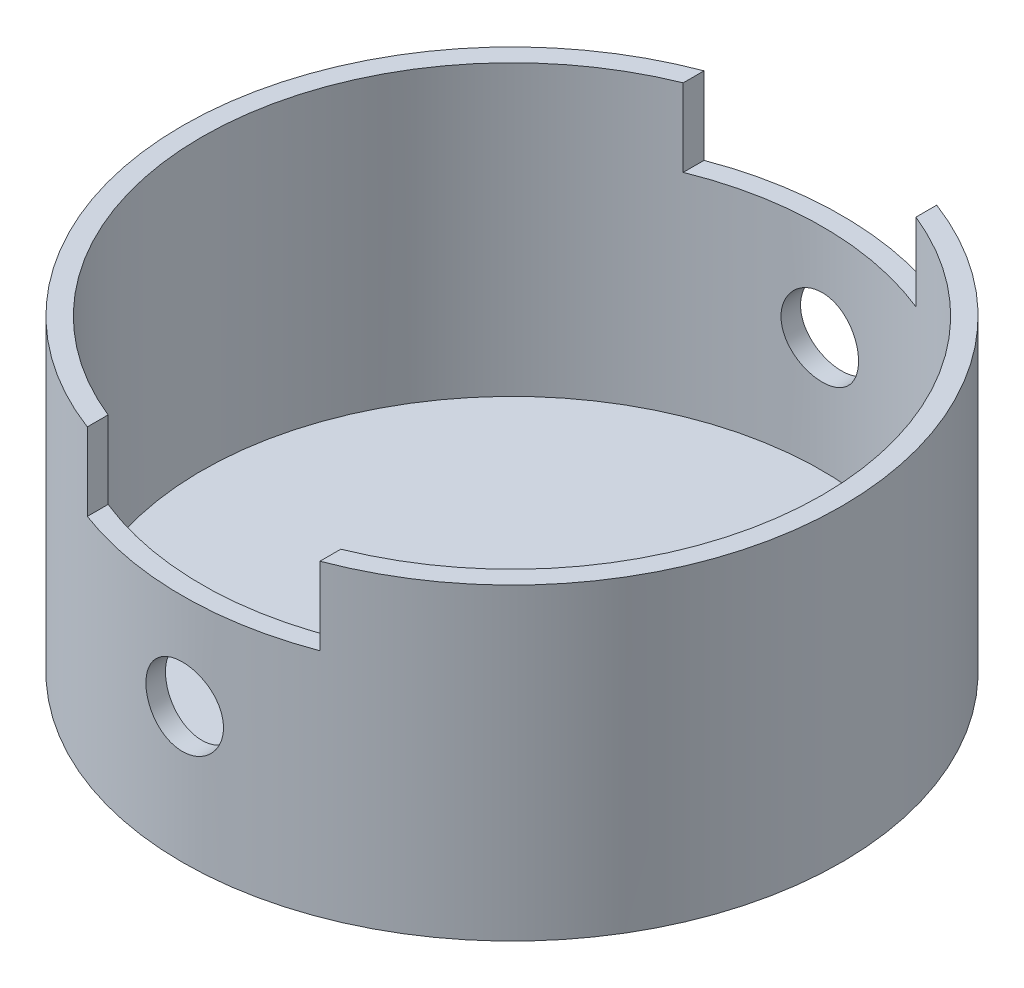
from build123d import *

# Parameters (mm, degrees)
SKETCH1_R           = 53.975
EXTRUDE1_DEPTH      = 50.4952
SHELL1_T            = -3.175
EXTRUDE2_DEPTH      = 92.522491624
EXTRUDE2_DEPTH_BACK = 92.522491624
SKETCH2_W           = 38.1
SKETCH2_H           = 12.7
EXTRUDE3_DEPTH      = 92.522491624
EXTRUDE3_DEPTH_BACK = 92.522491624
SKETCH3_R           = 6.35


with BuildPart() as part:
    # Sketch1 → Extrude1 (new body)
    with BuildSketch(Plane(origin=(0, 0, 0), x_dir=(1, 0, 0), z_dir=(0, 1, 0))):
        with Locations(Location((0, 0, 0), (0, 0, 270))):
            Circle(SKETCH1_R)
    extrude(amount=EXTRUDE1_DEPTH)

    # Shell1
    shell1_openings = [part.faces().sort_by_distance(p)[0] for p in [
        (0, 50.4952, 0),
    ]]
    offset(amount=SHELL1_T, openings=shell1_openings, kind=Kind.INTERSECTION)

    # Sketch2 → Extrude2 (cut, two sides: drawn at the far end of the back side and taken through both)
    with BuildSketch(Plane.XY.offset(-EXTRUDE2_DEPTH_BACK)):
        with Locations((0, 44.1452)):
            Rectangle(SKETCH2_W, SKETCH2_H)
    extrude(amount=EXTRUDE2_DEPTH + EXTRUDE2_DEPTH_BACK, mode=Mode.SUBTRACT)

    # Sketch3 → Extrude3 (cut, two sides: drawn at the far end of the back side and taken through both)
    with BuildSketch(Plane.XY.offset(-EXTRUDE3_DEPTH_BACK)):
        with Locations((0, 22.0726)):
            Circle(SKETCH3_R)
    extrude(amount=EXTRUDE3_DEPTH + EXTRUDE3_DEPTH_BACK, mode=Mode.SUBTRACT)


solid = part.part
